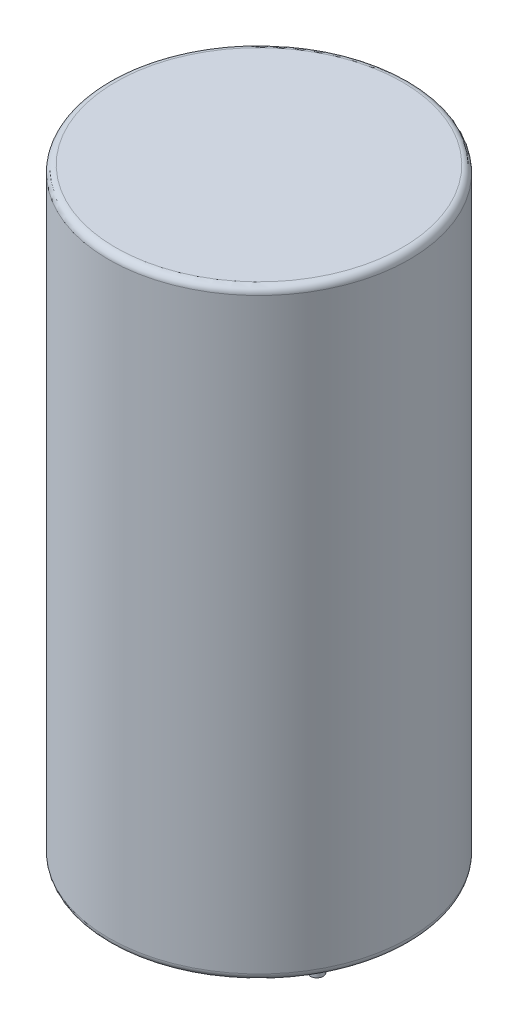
from build123d import *

# Parameters (mm, degrees)
SKETCH1_R           = 6.5
BOSS_EXTRUDE1_DEPTH = 26
FILLET1_R           = 0.3
SKETCH2_R           = 0.275
BOSS_EXTRUDE2_DEPTH = 3


with BuildPart() as part:
    # Sketch1 → Boss-Extrude1 (new body)
    with BuildSketch(Plane(origin=(0, 0, 0), x_dir=(1, 0, 0), z_dir=(0, 1, 0))):
        with Locations(Location((0, 0, 0), (0, 0, 90))):
            Circle(SKETCH1_R)
    extrude(amount=BOSS_EXTRUDE1_DEPTH)

    # Fillet1
    fillet1_edges = [part.edges().sort_by_distance(p)[0] for p in [
        (0, 0, 6.5),
        (0, 26, 6.5),
    ]]
    fillet(fillet1_edges, radius=FILLET1_R)

    # Sketch2 → Boss-Extrude2 (add)
    with BuildSketch(Plane.XZ):
        with Locations(Location((-2.5, 0, 0), (0, 0, 90))):
            Circle(SKETCH2_R)
        with Locations(Location((2.5, 0, 0), (0, 0, 90))):
            Circle(SKETCH2_R)
    extrude(amount=BOSS_EXTRUDE2_DEPTH)


solid = part.part
